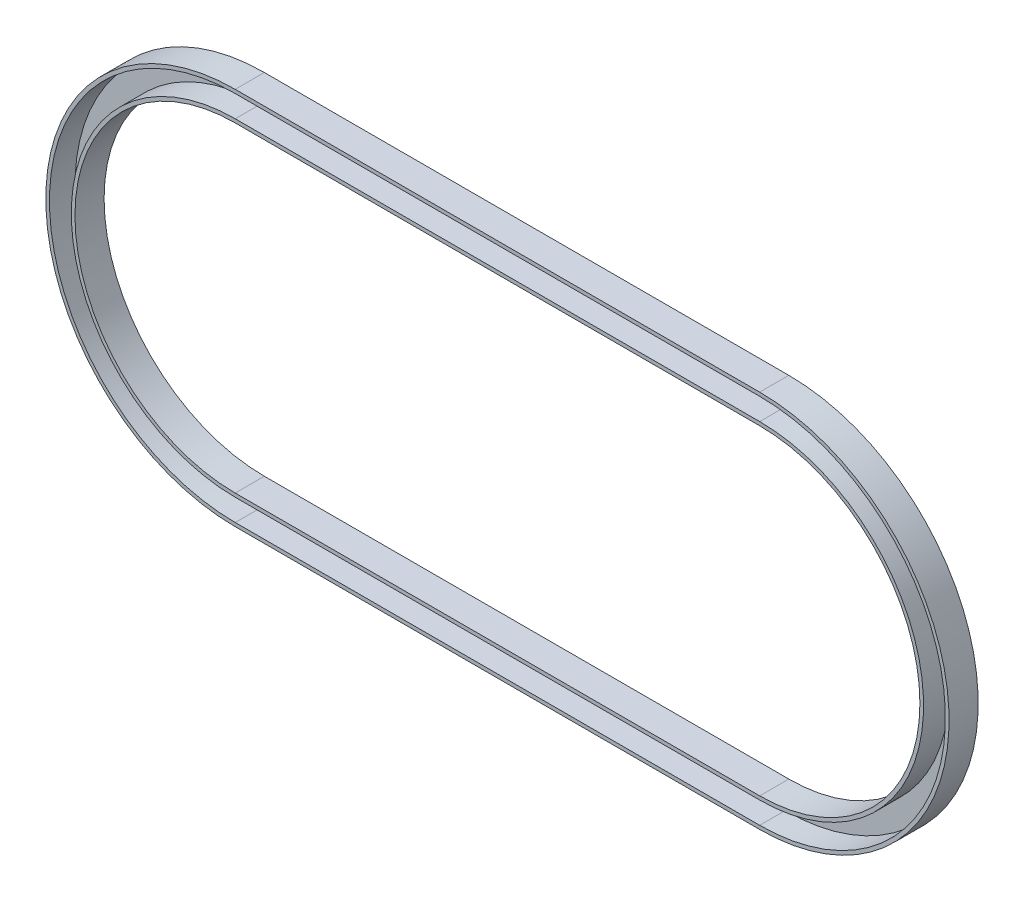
ISO-10303-21;
HEADER;
FILE_DESCRIPTION(('STEP AP214'),'2;1');
FILE_NAME('part.step','',(''),(''),'','','');
FILE_SCHEMA(('AUTOMOTIVE_DESIGN { 1 0 10303 214 1 1 1 1 }'));
ENDSEC;
DATA;
#1=APPLICATION_CONTEXT('core data for automotive mechanical design processes');
#2=APPLICATION_PROTOCOL_DEFINITION('international standard','automotive_design',2000,#1);
#3=PRODUCT_CONTEXT('',#1,'mechanical');
#4=PRODUCT('Part','Part','',(#3));
#5=PRODUCT_RELATED_PRODUCT_CATEGORY('part','',(#4));
#6=PRODUCT_DEFINITION_FORMATION('','',#4);
#7=PRODUCT_DEFINITION_CONTEXT('part definition',#1,'design');
#8=PRODUCT_DEFINITION('design','',#6,#7);
#9=PRODUCT_DEFINITION_SHAPE('','',#8);
#10=(LENGTH_UNIT() NAMED_UNIT(*) SI_UNIT(.MILLI.,.METRE.));
#11=(NAMED_UNIT(*) PLANE_ANGLE_UNIT() SI_UNIT($,.RADIAN.));
#12=(NAMED_UNIT(*) SI_UNIT($,.STERADIAN.) SOLID_ANGLE_UNIT());
#13=UNCERTAINTY_MEASURE_WITH_UNIT(LENGTH_MEASURE(1.E-05),#10,'distance_accuracy_value','');
#14=(GEOMETRIC_REPRESENTATION_CONTEXT(3) GLOBAL_UNCERTAINTY_ASSIGNED_CONTEXT((#13)) GLOBAL_UNIT_ASSIGNED_CONTEXT((#10,
#11,#12)) REPRESENTATION_CONTEXT('',''));
#15=CARTESIAN_POINT('',(0.,0.,0.));
#16=DIRECTION('',(0.,0.,1.));
#17=DIRECTION('',(1.,0.,0.));
#18=AXIS2_PLACEMENT_3D('',#15,#16,#17);
#19=CARTESIAN_POINT('',(0.,0.,25.4));
#20=DIRECTION('',(0.,0.,1.));
#21=DIRECTION('',(1.,0.,0.));
#22=AXIS2_PLACEMENT_3D('',#19,#20,#21);
#23=PLANE('',#22);
#24=DIRECTION('',(1.,0.,0.));
#25=VECTOR('',#24,1.);
#26=CARTESIAN_POINT('',(0.,-139.7,25.4));
#27=LINE('',#26,#25);
#28=CARTESIAN_POINT('',(0.,-139.7,25.4));
#29=VERTEX_POINT('',#28);
#30=CARTESIAN_POINT('',(457.2,-139.7,25.4));
#31=VERTEX_POINT('',#30);
#32=EDGE_CURVE('E218',#29,#31,#27,.T.);
#33=ORIENTED_EDGE('',*,*,#32,.F.);
#34=CARTESIAN_POINT('',(0.,0.,25.4));
#35=DIRECTION('',(0.,0.,1.));
#36=DIRECTION('',(1.,0.,0.));
#37=AXIS2_PLACEMENT_3D('',#34,#35,#36);
#38=CIRCLE('',#37,139.7);
#39=CARTESIAN_POINT('',(0.,139.7,25.4));
#40=VERTEX_POINT('',#39);
#41=EDGE_CURVE('E216',#40,#29,#38,.T.);
#42=ORIENTED_EDGE('',*,*,#41,.F.);
#43=DIRECTION('',(-1.,0.,0.));
#44=VECTOR('',#43,1.);
#45=CARTESIAN_POINT('',(457.2,139.7,25.4));
#46=LINE('',#45,#44);
#47=CARTESIAN_POINT('',(457.2,139.7,25.4));
#48=VERTEX_POINT('',#47);
#49=EDGE_CURVE('E224',#48,#40,#46,.T.);
#50=ORIENTED_EDGE('',*,*,#49,.F.);
#51=CARTESIAN_POINT('',(457.2,0.,25.4));
#52=DIRECTION('',(0.,0.,1.));
#53=DIRECTION('',(1.,0.,0.));
#54=AXIS2_PLACEMENT_3D('',#51,#52,#53);
#55=CIRCLE('',#54,139.7);
#56=EDGE_CURVE('E221',#31,#48,#55,.T.);
#57=ORIENTED_EDGE('',*,*,#56,.F.);
#58=EDGE_LOOP('',(#33,#42,#50,#57));
#59=FACE_BOUND('',#58,.T.);
#60=CARTESIAN_POINT('',(0.,0.,25.4));
#61=DIRECTION('',(0.,0.,1.));
#62=DIRECTION('',(1.,0.,0.));
#63=AXIS2_PLACEMENT_3D('',#60,#61,#62);
#64=CIRCLE('',#63,142.875);
#65=CARTESIAN_POINT('',(0.,142.875,25.4));
#66=VERTEX_POINT('',#65);
#67=CARTESIAN_POINT('',(0.,-142.875,25.4));
#68=VERTEX_POINT('',#67);
#69=EDGE_CURVE('E188',#66,#68,#64,.T.);
#70=ORIENTED_EDGE('',*,*,#69,.T.);
#71=DIRECTION('',(1.,0.,0.));
#72=VECTOR('',#71,1.);
#73=CARTESIAN_POINT('',(0.,-142.875,25.4));
#74=LINE('',#73,#72);
#75=CARTESIAN_POINT('',(457.2,-142.875,25.4));
#76=VERTEX_POINT('',#75);
#77=EDGE_CURVE('E209',#68,#76,#74,.T.);
#78=ORIENTED_EDGE('',*,*,#77,.T.);
#79=CARTESIAN_POINT('',(457.2,0.,25.4));
#80=DIRECTION('',(0.,0.,1.));
#81=DIRECTION('',(1.,0.,0.));
#82=AXIS2_PLACEMENT_3D('',#79,#80,#81);
#83=CIRCLE('',#82,142.875);
#84=CARTESIAN_POINT('',(457.2,142.875,25.4));
#85=VERTEX_POINT('',#84);
#86=EDGE_CURVE('E211',#76,#85,#83,.T.);
#87=ORIENTED_EDGE('',*,*,#86,.T.);
#88=DIRECTION('',(-1.,0.,0.));
#89=VECTOR('',#88,1.);
#90=CARTESIAN_POINT('',(457.2,142.875,25.4));
#91=LINE('',#90,#89);
#92=EDGE_CURVE('E55',#85,#66,#91,.T.);
#93=ORIENTED_EDGE('',*,*,#92,.T.);
#94=EDGE_LOOP('',(#70,#78,#87,#93));
#95=FACE_BOUND('',#94,.T.);
#96=ADVANCED_FACE('F32',(#59,#95),#23,.T.);
#97=CARTESIAN_POINT('',(0.,0.,25.4));
#98=DIRECTION('',(0.,0.,1.));
#99=DIRECTION('',(1.,0.,0.));
#100=AXIS2_PLACEMENT_3D('',#97,#98,#99);
#101=CIRCLE('',#100,161.925);
#102=CARTESIAN_POINT('',(0.,161.925,25.4));
#103=VERTEX_POINT('',#102);
#104=CARTESIAN_POINT('',(0.,-161.925,25.4));
#105=VERTEX_POINT('',#104);
#106=EDGE_CURVE('E153',#103,#105,#101,.T.);
#107=ORIENTED_EDGE('',*,*,#106,.F.);
#108=DIRECTION('',(-1.,0.,0.));
#109=VECTOR('',#108,1.);
#110=CARTESIAN_POINT('',(457.2,161.925,25.4));
#111=LINE('',#110,#109);
#112=CARTESIAN_POINT('',(457.2,161.925,25.4));
#113=VERTEX_POINT('',#112);
#114=EDGE_CURVE('E159',#113,#103,#111,.T.);
#115=ORIENTED_EDGE('',*,*,#114,.F.);
#116=CARTESIAN_POINT('',(457.2,0.,25.4));
#117=DIRECTION('',(0.,0.,1.));
#118=DIRECTION('',(1.,0.,0.));
#119=AXIS2_PLACEMENT_3D('',#116,#117,#118);
#120=CIRCLE('',#119,161.925);
#121=CARTESIAN_POINT('',(457.2,-161.925,25.4));
#122=VERTEX_POINT('',#121);
#123=EDGE_CURVE('E204',#122,#113,#120,.T.);
#124=ORIENTED_EDGE('',*,*,#123,.F.);
#125=DIRECTION('',(1.,0.,0.));
#126=VECTOR('',#125,1.);
#127=CARTESIAN_POINT('',(0.,-161.925,25.4));
#128=LINE('',#127,#126);
#129=EDGE_CURVE('E202',#105,#122,#128,.T.);
#130=ORIENTED_EDGE('',*,*,#129,.F.);
#131=EDGE_LOOP('',(#107,#115,#124,#130));
#132=FACE_BOUND('',#131,.T.);
#133=CARTESIAN_POINT('',(0.,0.,25.4));
#134=DIRECTION('',(0.,0.,1.));
#135=DIRECTION('',(1.,0.,0.));
#136=AXIS2_PLACEMENT_3D('',#133,#134,#135);
#137=CIRCLE('',#136,165.1);
#138=CARTESIAN_POINT('',(0.,165.1,25.4));
#139=VERTEX_POINT('',#138);
#140=CARTESIAN_POINT('',(0.,-165.1,25.4));
#141=VERTEX_POINT('',#140);
#142=EDGE_CURVE('E247',#139,#141,#137,.T.);
#143=ORIENTED_EDGE('',*,*,#142,.T.);
#144=DIRECTION('',(1.,0.,0.));
#145=VECTOR('',#144,1.);
#146=CARTESIAN_POINT('',(0.,-165.1,25.4));
#147=LINE('',#146,#145);
#148=CARTESIAN_POINT('',(457.2,-165.1,25.4));
#149=VERTEX_POINT('',#148);
#150=EDGE_CURVE('E250',#141,#149,#147,.T.);
#151=ORIENTED_EDGE('',*,*,#150,.T.);
#152=CARTESIAN_POINT('',(457.2,0.,25.4));
#153=DIRECTION('',(0.,0.,1.));
#154=DIRECTION('',(1.,0.,0.));
#155=AXIS2_PLACEMENT_3D('',#152,#153,#154);
#156=CIRCLE('',#155,165.1);
#157=CARTESIAN_POINT('',(457.2,165.1,25.4));
#158=VERTEX_POINT('',#157);
#159=EDGE_CURVE('E253',#149,#158,#156,.T.);
#160=ORIENTED_EDGE('',*,*,#159,.T.);
#161=DIRECTION('',(-1.,0.,0.));
#162=VECTOR('',#161,1.);
#163=CARTESIAN_POINT('',(457.2,165.1,25.4));
#164=LINE('',#163,#162);
#165=EDGE_CURVE('E255',#158,#139,#164,.T.);
#166=ORIENTED_EDGE('',*,*,#165,.T.);
#167=EDGE_LOOP('',(#143,#151,#160,#166));
#168=FACE_BOUND('',#167,.T.);
#169=ADVANCED_FACE('F290',(#132,#168),#23,.T.);
#170=CARTESIAN_POINT('',(0.,0.,0.));
#171=DIRECTION('',(0.,0.,1.));
#172=DIRECTION('',(1.,0.,0.));
#173=AXIS2_PLACEMENT_3D('',#170,#171,#172);
#174=PLANE('',#173);
#175=CARTESIAN_POINT('',(0.,0.,0.));
#176=DIRECTION('',(0.,0.,1.));
#177=DIRECTION('',(1.,0.,0.));
#178=AXIS2_PLACEMENT_3D('',#175,#176,#177);
#179=CIRCLE('',#178,165.1);
#180=CARTESIAN_POINT('',(0.,165.1,0.));
#181=VERTEX_POINT('',#180);
#182=CARTESIAN_POINT('',(0.,-165.1,0.));
#183=VERTEX_POINT('',#182);
#184=EDGE_CURVE('E246',#181,#183,#179,.T.);
#185=ORIENTED_EDGE('',*,*,#184,.F.);
#186=DIRECTION('',(-1.,0.,0.));
#187=VECTOR('',#186,1.);
#188=CARTESIAN_POINT('',(457.2,165.1,0.));
#189=LINE('',#188,#187);
#190=CARTESIAN_POINT('',(457.2,165.1,0.));
#191=VERTEX_POINT('',#190);
#192=EDGE_CURVE('E251',#191,#181,#189,.T.);
#193=ORIENTED_EDGE('',*,*,#192,.F.);
#194=CARTESIAN_POINT('',(457.2,0.,0.));
#195=DIRECTION('',(0.,0.,1.));
#196=DIRECTION('',(1.,0.,0.));
#197=AXIS2_PLACEMENT_3D('',#194,#195,#196);
#198=CIRCLE('',#197,165.1);
#199=CARTESIAN_POINT('',(457.2,-165.1,0.));
#200=VERTEX_POINT('',#199);
#201=EDGE_CURVE('E262',#200,#191,#198,.T.);
#202=ORIENTED_EDGE('',*,*,#201,.F.);
#203=DIRECTION('',(1.,0.,0.));
#204=VECTOR('',#203,1.);
#205=CARTESIAN_POINT('',(0.,-165.1,0.));
#206=LINE('',#205,#204);
#207=EDGE_CURVE('E260',#183,#200,#206,.T.);
#208=ORIENTED_EDGE('',*,*,#207,.F.);
#209=EDGE_LOOP('',(#185,#193,#202,#208));
#210=FACE_BOUND('',#209,.T.);
#211=CARTESIAN_POINT('',(0.,0.,0.));
#212=DIRECTION('',(0.,0.,1.));
#213=DIRECTION('',(1.,0.,0.));
#214=AXIS2_PLACEMENT_3D('',#211,#212,#213);
#215=CIRCLE('',#214,139.7);
#216=CARTESIAN_POINT('',(0.,139.7,0.));
#217=VERTEX_POINT('',#216);
#218=CARTESIAN_POINT('',(0.,-139.7,0.));
#219=VERTEX_POINT('',#218);
#220=EDGE_CURVE('E189',#217,#219,#215,.T.);
#221=ORIENTED_EDGE('',*,*,#220,.T.);
#222=DIRECTION('',(1.,0.,0.));
#223=VECTOR('',#222,1.);
#224=CARTESIAN_POINT('',(0.,-139.7,0.));
#225=LINE('',#224,#223);
#226=CARTESIAN_POINT('',(457.2,-139.7,0.));
#227=VERTEX_POINT('',#226);
#228=EDGE_CURVE('E229',#219,#227,#225,.T.);
#229=ORIENTED_EDGE('',*,*,#228,.T.);
#230=CARTESIAN_POINT('',(457.2,0.,0.));
#231=DIRECTION('',(0.,0.,1.));
#232=DIRECTION('',(1.,0.,0.));
#233=AXIS2_PLACEMENT_3D('',#230,#231,#232);
#234=CIRCLE('',#233,139.7);
#235=CARTESIAN_POINT('',(457.2,139.7,0.));
#236=VERTEX_POINT('',#235);
#237=EDGE_CURVE('E232',#227,#236,#234,.T.);
#238=ORIENTED_EDGE('',*,*,#237,.T.);
#239=DIRECTION('',(-1.,0.,0.));
#240=VECTOR('',#239,1.);
#241=CARTESIAN_POINT('',(457.2,139.7,0.));
#242=LINE('',#241,#240);
#243=EDGE_CURVE('E219',#236,#217,#242,.T.);
#244=ORIENTED_EDGE('',*,*,#243,.T.);
#245=EDGE_LOOP('',(#221,#229,#238,#244));
#246=FACE_BOUND('',#245,.T.);
#247=ADVANCED_FACE('F280',(#210,#246),#174,.F.);
#248=CARTESIAN_POINT('',(0.,0.,25.4));
#249=DIRECTION('',(0.,0.,-1.));
#250=DIRECTION('',(-1.,0.,0.));
#251=AXIS2_PLACEMENT_3D('',#248,#249,#250);
#252=CYLINDRICAL_SURFACE('',#251,165.1);
#253=ORIENTED_EDGE('',*,*,#184,.T.);
#254=DIRECTION('',(0.,0.,-1.));
#255=VECTOR('',#254,1.);
#256=CARTESIAN_POINT('',(0.,-165.1,25.4));
#257=LINE('',#256,#255);
#258=EDGE_CURVE('E11',#141,#183,#257,.T.);
#259=ORIENTED_EDGE('',*,*,#258,.F.);
#260=ORIENTED_EDGE('',*,*,#142,.F.);
#261=DIRECTION('',(0.,0.,-1.));
#262=VECTOR('',#261,1.);
#263=CARTESIAN_POINT('',(0.,165.1,25.4));
#264=LINE('',#263,#262);
#265=EDGE_CURVE('E257',#139,#181,#264,.T.);
#266=ORIENTED_EDGE('',*,*,#265,.T.);
#267=EDGE_LOOP('',(#253,#259,#260,#266));
#268=FACE_BOUND('',#267,.T.);
#269=ADVANCED_FACE('F34',(#268),#252,.T.);
#270=CARTESIAN_POINT('',(0.,-165.1,25.4));
#271=DIRECTION('',(0.,1.,0.));
#272=DIRECTION('',(0.,0.,1.));
#273=AXIS2_PLACEMENT_3D('',#270,#271,#272);
#274=PLANE('',#273);
#275=ORIENTED_EDGE('',*,*,#207,.T.);
#276=DIRECTION('',(0.,0.,-1.));
#277=VECTOR('',#276,1.);
#278=CARTESIAN_POINT('',(457.2,-165.1,25.4));
#279=LINE('',#278,#277);
#280=EDGE_CURVE('E40',#149,#200,#279,.T.);
#281=ORIENTED_EDGE('',*,*,#280,.F.);
#282=ORIENTED_EDGE('',*,*,#150,.F.);
#283=ORIENTED_EDGE('',*,*,#258,.T.);
#284=EDGE_LOOP('',(#275,#281,#282,#283));
#285=FACE_BOUND('',#284,.T.);
#286=ADVANCED_FACE('F291',(#285),#274,.F.);
#287=CARTESIAN_POINT('',(457.2,0.,25.4));
#288=DIRECTION('',(0.,0.,-1.));
#289=DIRECTION('',(-1.,0.,0.));
#290=AXIS2_PLACEMENT_3D('',#287,#288,#289);
#291=CYLINDRICAL_SURFACE('',#290,165.1);
#292=ORIENTED_EDGE('',*,*,#201,.T.);
#293=DIRECTION('',(0.,0.,-1.));
#294=VECTOR('',#293,1.);
#295=CARTESIAN_POINT('',(457.2,165.1,25.4));
#296=LINE('',#295,#294);
#297=EDGE_CURVE('E267',#158,#191,#296,.T.);
#298=ORIENTED_EDGE('',*,*,#297,.F.);
#299=ORIENTED_EDGE('',*,*,#159,.F.);
#300=ORIENTED_EDGE('',*,*,#280,.T.);
#301=EDGE_LOOP('',(#292,#298,#299,#300));
#302=FACE_BOUND('',#301,.T.);
#303=ADVANCED_FACE('F274',(#302),#291,.T.);
#304=CARTESIAN_POINT('',(457.2,165.1,25.4));
#305=DIRECTION('',(0.,-1.,0.));
#306=DIRECTION('',(1.,0.,0.));
#307=AXIS2_PLACEMENT_3D('',#304,#305,#306);
#308=PLANE('',#307);
#309=ORIENTED_EDGE('',*,*,#192,.T.);
#310=ORIENTED_EDGE('',*,*,#265,.F.);
#311=ORIENTED_EDGE('',*,*,#165,.F.);
#312=ORIENTED_EDGE('',*,*,#297,.T.);
#313=EDGE_LOOP('',(#309,#310,#311,#312));
#314=FACE_BOUND('',#313,.T.);
#315=ADVANCED_FACE('F284',(#314),#308,.F.);
#316=CARTESIAN_POINT('',(0.,0.,25.4));
#317=DIRECTION('',(0.,0.,-1.));
#318=DIRECTION('',(-1.,0.,0.));
#319=AXIS2_PLACEMENT_3D('',#316,#317,#318);
#320=CYLINDRICAL_SURFACE('',#319,139.7);
#321=ORIENTED_EDGE('',*,*,#220,.F.);
#322=DIRECTION('',(0.,0.,-1.));
#323=VECTOR('',#322,1.);
#324=CARTESIAN_POINT('',(0.,139.7,25.4));
#325=LINE('',#324,#323);
#326=EDGE_CURVE('E226',#40,#217,#325,.T.);
#327=ORIENTED_EDGE('',*,*,#326,.F.);
#328=ORIENTED_EDGE('',*,*,#41,.T.);
#329=DIRECTION('',(0.,0.,-1.));
#330=VECTOR('',#329,1.);
#331=CARTESIAN_POINT('',(0.,-139.7,25.4));
#332=LINE('',#331,#330);
#333=EDGE_CURVE('E243',#29,#219,#332,.T.);
#334=ORIENTED_EDGE('',*,*,#333,.T.);
#335=EDGE_LOOP('',(#321,#327,#328,#334));
#336=FACE_BOUND('',#335,.T.);
#337=ADVANCED_FACE('F309',(#336),#320,.F.);
#338=CARTESIAN_POINT('',(0.,-139.7,25.4));
#339=DIRECTION('',(0.,1.,0.));
#340=DIRECTION('',(-1.,0.,0.));
#341=AXIS2_PLACEMENT_3D('',#338,#339,#340);
#342=PLANE('',#341);
#343=ORIENTED_EDGE('',*,*,#228,.F.);
#344=ORIENTED_EDGE('',*,*,#333,.F.);
#345=ORIENTED_EDGE('',*,*,#32,.T.);
#346=DIRECTION('',(0.,0.,-1.));
#347=VECTOR('',#346,1.);
#348=CARTESIAN_POINT('',(457.2,-139.7,25.4));
#349=LINE('',#348,#347);
#350=EDGE_CURVE('E241',#31,#227,#349,.T.);
#351=ORIENTED_EDGE('',*,*,#350,.T.);
#352=EDGE_LOOP('',(#343,#344,#345,#351));
#353=FACE_BOUND('',#352,.T.);
#354=ADVANCED_FACE('F317',(#353),#342,.T.);
#355=CARTESIAN_POINT('',(457.2,0.,25.4));
#356=DIRECTION('',(0.,0.,-1.));
#357=DIRECTION('',(-1.,0.,0.));
#358=AXIS2_PLACEMENT_3D('',#355,#356,#357);
#359=CYLINDRICAL_SURFACE('',#358,139.7);
#360=ORIENTED_EDGE('',*,*,#237,.F.);
#361=ORIENTED_EDGE('',*,*,#350,.F.);
#362=ORIENTED_EDGE('',*,*,#56,.T.);
#363=DIRECTION('',(0.,0.,-1.));
#364=VECTOR('',#363,1.);
#365=CARTESIAN_POINT('',(457.2,139.7,25.4));
#366=LINE('',#365,#364);
#367=EDGE_CURVE('E239',#48,#236,#366,.T.);
#368=ORIENTED_EDGE('',*,*,#367,.T.);
#369=EDGE_LOOP('',(#360,#361,#362,#368));
#370=FACE_BOUND('',#369,.T.);
#371=ADVANCED_FACE('F322',(#370),#359,.F.);
#372=CARTESIAN_POINT('',(457.2,139.7,25.4));
#373=DIRECTION('',(0.,-1.,0.));
#374=DIRECTION('',(1.,0.,0.));
#375=AXIS2_PLACEMENT_3D('',#372,#373,#374);
#376=PLANE('',#375);
#377=ORIENTED_EDGE('',*,*,#243,.F.);
#378=ORIENTED_EDGE('',*,*,#367,.F.);
#379=ORIENTED_EDGE('',*,*,#49,.T.);
#380=ORIENTED_EDGE('',*,*,#326,.T.);
#381=EDGE_LOOP('',(#377,#378,#379,#380));
#382=FACE_BOUND('',#381,.T.);
#383=ADVANCED_FACE('F329',(#382),#376,.T.);
#384=CARTESIAN_POINT('',(0.,0.,3.175));
#385=DIRECTION('',(0.,0.,1.));
#386=DIRECTION('',(1.,0.,0.));
#387=AXIS2_PLACEMENT_3D('',#384,#385,#386);
#388=PLANE('',#387);
#389=CARTESIAN_POINT('',(0.,0.,3.175));
#390=DIRECTION('',(0.,0.,1.));
#391=DIRECTION('',(1.,0.,0.));
#392=AXIS2_PLACEMENT_3D('',#389,#390,#391);
#393=CIRCLE('',#392,161.925);
#394=CARTESIAN_POINT('',(0.,161.925,3.175));
#395=VERTEX_POINT('',#394);
#396=CARTESIAN_POINT('',(0.,-161.925,3.175));
#397=VERTEX_POINT('',#396);
#398=EDGE_CURVE('E150',#395,#397,#393,.T.);
#399=ORIENTED_EDGE('',*,*,#398,.T.);
#400=DIRECTION('',(1.,0.,0.));
#401=VECTOR('',#400,1.);
#402=CARTESIAN_POINT('',(0.,-161.925,3.175));
#403=LINE('',#402,#401);
#404=CARTESIAN_POINT('',(457.2,-161.925,3.175));
#405=VERTEX_POINT('',#404);
#406=EDGE_CURVE('E167',#397,#405,#403,.T.);
#407=ORIENTED_EDGE('',*,*,#406,.T.);
#408=CARTESIAN_POINT('',(457.2,0.,3.175));
#409=DIRECTION('',(0.,0.,1.));
#410=DIRECTION('',(1.,0.,0.));
#411=AXIS2_PLACEMENT_3D('',#408,#409,#410);
#412=CIRCLE('',#411,161.925);
#413=CARTESIAN_POINT('',(457.2,161.925,3.175));
#414=VERTEX_POINT('',#413);
#415=EDGE_CURVE('E152',#405,#414,#412,.T.);
#416=ORIENTED_EDGE('',*,*,#415,.T.);
#417=DIRECTION('',(-1.,0.,0.));
#418=VECTOR('',#417,1.);
#419=CARTESIAN_POINT('',(457.2,161.925,3.175));
#420=LINE('',#419,#418);
#421=EDGE_CURVE('E145',#414,#395,#420,.T.);
#422=ORIENTED_EDGE('',*,*,#421,.T.);
#423=EDGE_LOOP('',(#399,#407,#416,#422));
#424=FACE_BOUND('',#423,.T.);
#425=CARTESIAN_POINT('',(0.,0.,3.175));
#426=DIRECTION('',(0.,0.,1.));
#427=DIRECTION('',(1.,0.,0.));
#428=AXIS2_PLACEMENT_3D('',#425,#426,#427);
#429=CIRCLE('',#428,142.875);
#430=CARTESIAN_POINT('',(0.,142.875,3.175));
#431=VERTEX_POINT('',#430);
#432=CARTESIAN_POINT('',(0.,-142.875,3.175));
#433=VERTEX_POINT('',#432);
#434=EDGE_CURVE('E176',#431,#433,#429,.T.);
#435=ORIENTED_EDGE('',*,*,#434,.F.);
#436=DIRECTION('',(-1.,0.,0.));
#437=VECTOR('',#436,1.);
#438=CARTESIAN_POINT('',(457.2,142.875,3.175));
#439=LINE('',#438,#437);
#440=CARTESIAN_POINT('',(457.2,142.875,3.175));
#441=VERTEX_POINT('',#440);
#442=EDGE_CURVE('E185',#441,#431,#439,.T.);
#443=ORIENTED_EDGE('',*,*,#442,.F.);
#444=CARTESIAN_POINT('',(457.2,0.,3.175));
#445=DIRECTION('',(0.,0.,1.));
#446=DIRECTION('',(1.,0.,0.));
#447=AXIS2_PLACEMENT_3D('',#444,#445,#446);
#448=CIRCLE('',#447,142.875);
#449=CARTESIAN_POINT('',(457.2,-142.875,3.175));
#450=VERTEX_POINT('',#449);
#451=EDGE_CURVE('E182',#450,#441,#448,.T.);
#452=ORIENTED_EDGE('',*,*,#451,.F.);
#453=DIRECTION('',(1.,0.,0.));
#454=VECTOR('',#453,1.);
#455=CARTESIAN_POINT('',(0.,-142.875,3.175));
#456=LINE('',#455,#454);
#457=EDGE_CURVE('E179',#433,#450,#456,.T.);
#458=ORIENTED_EDGE('',*,*,#457,.F.);
#459=EDGE_LOOP('',(#435,#443,#452,#458));
#460=FACE_BOUND('',#459,.T.);
#461=ADVANCED_FACE('F147',(#424,#460),#388,.T.);
#462=CARTESIAN_POINT('',(0.,0.,25.4));
#463=DIRECTION('',(0.,0.,-1.));
#464=DIRECTION('',(-1.,0.,0.));
#465=AXIS2_PLACEMENT_3D('',#462,#463,#464);
#466=CYLINDRICAL_SURFACE('',#465,161.925);
#467=ORIENTED_EDGE('',*,*,#398,.F.);
#468=DIRECTION('',(0.,0.,-1.));
#469=VECTOR('',#468,1.);
#470=CARTESIAN_POINT('',(0.,161.925,25.4));
#471=LINE('',#470,#469);
#472=EDGE_CURVE('E156',#103,#395,#471,.T.);
#473=ORIENTED_EDGE('',*,*,#472,.F.);
#474=ORIENTED_EDGE('',*,*,#106,.T.);
#475=DIRECTION('',(0.,0.,1.));
#476=VECTOR('',#475,1.);
#477=CARTESIAN_POINT('',(0.,-161.925,25.4));
#478=LINE('',#477,#476);
#479=EDGE_CURVE('E166',#105,#397,#478,.F.);
#480=ORIENTED_EDGE('',*,*,#479,.T.);
#481=EDGE_LOOP('',(#467,#473,#474,#480));
#482=FACE_BOUND('',#481,.T.);
#483=ADVANCED_FACE('F164',(#482),#466,.F.);
#484=CARTESIAN_POINT('',(0.,-161.925,25.4));
#485=DIRECTION('',(0.,1.,0.));
#486=DIRECTION('',(0.,0.,1.));
#487=AXIS2_PLACEMENT_3D('',#484,#485,#486);
#488=PLANE('',#487);
#489=ORIENTED_EDGE('',*,*,#406,.F.);
#490=ORIENTED_EDGE('',*,*,#479,.F.);
#491=ORIENTED_EDGE('',*,*,#129,.T.);
#492=DIRECTION('',(0.,0.,-1.));
#493=VECTOR('',#492,1.);
#494=CARTESIAN_POINT('',(457.2,-161.925,25.4));
#495=LINE('',#494,#493);
#496=EDGE_CURVE('E190',#122,#405,#495,.T.);
#497=ORIENTED_EDGE('',*,*,#496,.T.);
#498=EDGE_LOOP('',(#489,#490,#491,#497));
#499=FACE_BOUND('',#498,.T.);
#500=ADVANCED_FACE('F362',(#499),#488,.T.);
#501=CARTESIAN_POINT('',(457.2,0.,25.4));
#502=DIRECTION('',(0.,0.,-1.));
#503=DIRECTION('',(-1.,0.,0.));
#504=AXIS2_PLACEMENT_3D('',#501,#502,#503);
#505=CYLINDRICAL_SURFACE('',#504,161.925);
#506=ORIENTED_EDGE('',*,*,#415,.F.);
#507=ORIENTED_EDGE('',*,*,#496,.F.);
#508=ORIENTED_EDGE('',*,*,#123,.T.);
#509=DIRECTION('',(0.,0.,1.));
#510=VECTOR('',#509,1.);
#511=CARTESIAN_POINT('',(457.2,161.925,25.4));
#512=LINE('',#511,#510);
#513=EDGE_CURVE('E47',#113,#414,#512,.F.);
#514=ORIENTED_EDGE('',*,*,#513,.T.);
#515=EDGE_LOOP('',(#506,#507,#508,#514));
#516=FACE_BOUND('',#515,.T.);
#517=ADVANCED_FACE('F359',(#516),#505,.F.);
#518=CARTESIAN_POINT('',(457.2,161.925,25.4));
#519=DIRECTION('',(0.,-1.,0.));
#520=DIRECTION('',(1.,0.,0.));
#521=AXIS2_PLACEMENT_3D('',#518,#519,#520);
#522=PLANE('',#521);
#523=ORIENTED_EDGE('',*,*,#421,.F.);
#524=ORIENTED_EDGE('',*,*,#513,.F.);
#525=ORIENTED_EDGE('',*,*,#114,.T.);
#526=ORIENTED_EDGE('',*,*,#472,.T.);
#527=EDGE_LOOP('',(#523,#524,#525,#526));
#528=FACE_BOUND('',#527,.T.);
#529=ADVANCED_FACE('F157',(#528),#522,.T.);
#530=CARTESIAN_POINT('',(0.,0.,25.4));
#531=DIRECTION('',(0.,0.,-1.));
#532=DIRECTION('',(-1.,0.,0.));
#533=AXIS2_PLACEMENT_3D('',#530,#531,#532);
#534=CYLINDRICAL_SURFACE('',#533,142.875);
#535=ORIENTED_EDGE('',*,*,#434,.T.);
#536=DIRECTION('',(0.,0.,-1.));
#537=VECTOR('',#536,1.);
#538=CARTESIAN_POINT('',(0.,-142.875,25.4));
#539=LINE('',#538,#537);
#540=EDGE_CURVE('E168',#68,#433,#539,.T.);
#541=ORIENTED_EDGE('',*,*,#540,.F.);
#542=ORIENTED_EDGE('',*,*,#69,.F.);
#543=DIRECTION('',(0.,0.,1.));
#544=VECTOR('',#543,1.);
#545=CARTESIAN_POINT('',(0.,142.875,25.4));
#546=LINE('',#545,#544);
#547=EDGE_CURVE('E195',#66,#431,#546,.F.);
#548=ORIENTED_EDGE('',*,*,#547,.T.);
#549=EDGE_LOOP('',(#535,#541,#542,#548));
#550=FACE_BOUND('',#549,.T.);
#551=ADVANCED_FACE('F352',(#550),#534,.T.);
#552=CARTESIAN_POINT('',(0.,-142.875,25.4));
#553=DIRECTION('',(0.,1.,0.));
#554=DIRECTION('',(-1.,0.,0.));
#555=AXIS2_PLACEMENT_3D('',#552,#553,#554);
#556=PLANE('',#555);
#557=ORIENTED_EDGE('',*,*,#457,.T.);
#558=DIRECTION('',(0.,0.,1.));
#559=VECTOR('',#558,1.);
#560=CARTESIAN_POINT('',(457.2,-142.875,25.4));
#561=LINE('',#560,#559);
#562=EDGE_CURVE('E172',#76,#450,#561,.F.);
#563=ORIENTED_EDGE('',*,*,#562,.F.);
#564=ORIENTED_EDGE('',*,*,#77,.F.);
#565=ORIENTED_EDGE('',*,*,#540,.T.);
#566=EDGE_LOOP('',(#557,#563,#564,#565));
#567=FACE_BOUND('',#566,.T.);
#568=ADVANCED_FACE('F348',(#567),#556,.F.);
#569=CARTESIAN_POINT('',(457.2,0.,25.4));
#570=DIRECTION('',(0.,0.,-1.));
#571=DIRECTION('',(-1.,0.,0.));
#572=AXIS2_PLACEMENT_3D('',#569,#570,#571);
#573=CYLINDRICAL_SURFACE('',#572,142.875);
#574=ORIENTED_EDGE('',*,*,#451,.T.);
#575=DIRECTION('',(0.,0.,-1.));
#576=VECTOR('',#575,1.);
#577=CARTESIAN_POINT('',(457.2,142.875,25.4));
#578=LINE('',#577,#576);
#579=EDGE_CURVE('E197',#85,#441,#578,.T.);
#580=ORIENTED_EDGE('',*,*,#579,.F.);
#581=ORIENTED_EDGE('',*,*,#86,.F.);
#582=ORIENTED_EDGE('',*,*,#562,.T.);
#583=EDGE_LOOP('',(#574,#580,#581,#582));
#584=FACE_BOUND('',#583,.T.);
#585=ADVANCED_FACE('F345',(#584),#573,.T.);
#586=CARTESIAN_POINT('',(457.2,142.875,25.4));
#587=DIRECTION('',(0.,-1.,0.));
#588=DIRECTION('',(1.,0.,0.));
#589=AXIS2_PLACEMENT_3D('',#586,#587,#588);
#590=PLANE('',#589);
#591=ORIENTED_EDGE('',*,*,#442,.T.);
#592=ORIENTED_EDGE('',*,*,#547,.F.);
#593=ORIENTED_EDGE('',*,*,#92,.F.);
#594=ORIENTED_EDGE('',*,*,#579,.T.);
#595=EDGE_LOOP('',(#591,#592,#593,#594));
#596=FACE_BOUND('',#595,.T.);
#597=ADVANCED_FACE('F342',(#596),#590,.F.);
#598=CLOSED_SHELL('',(#96,#169,#247,#269,#286,#303,#315,#337,#354,#371,#383,#461,#483,#500,#517,
#529,#551,#568,#585,#597));
#599=MANIFOLD_SOLID_BREP('B2',#598);
#600=ADVANCED_BREP_SHAPE_REPRESENTATION('',(#18,#599),#14);
#601=SHAPE_DEFINITION_REPRESENTATION(#9,#600);
ENDSEC;
END-ISO-10303-21;
